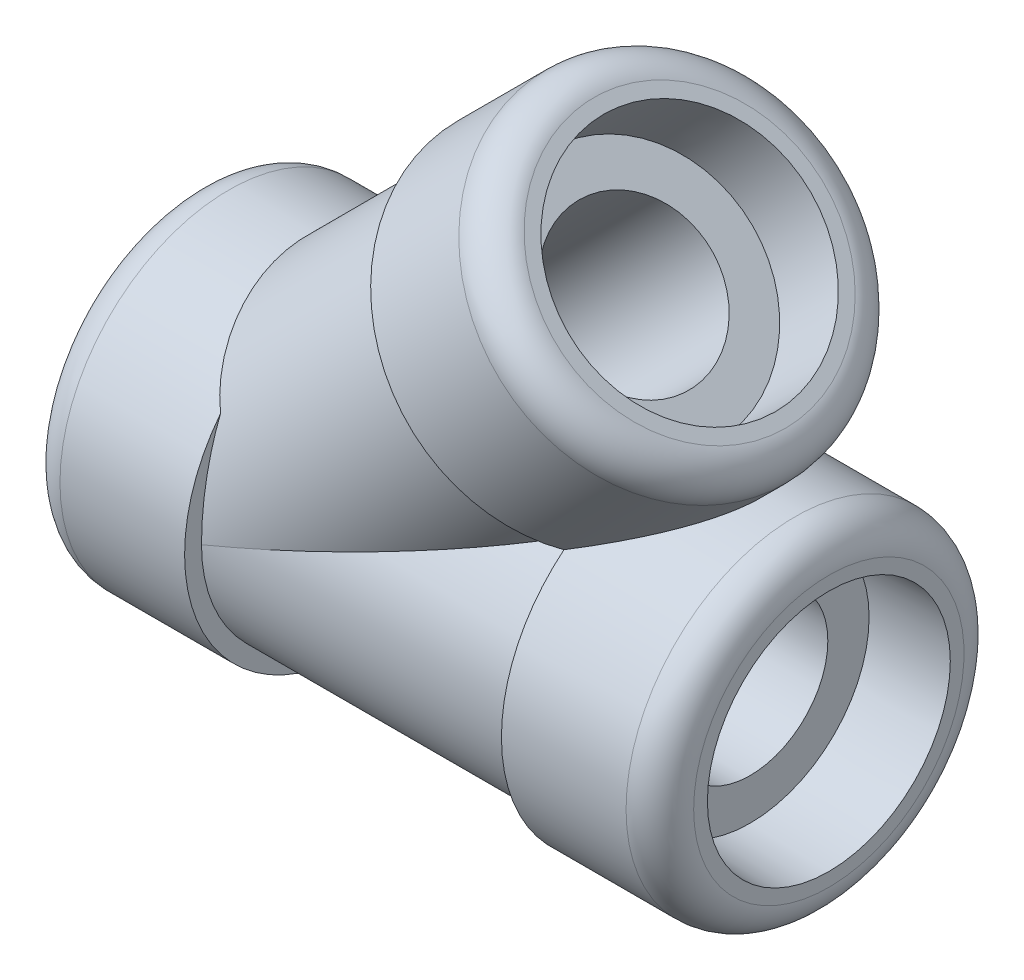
ISO-10303-21;
HEADER;
FILE_DESCRIPTION(('STEP AP214'),'2;1');
FILE_NAME('part.step','',(''),(''),'','','');
FILE_SCHEMA(('AUTOMOTIVE_DESIGN { 1 0 10303 214 1 1 1 1 }'));
ENDSEC;
DATA;
#1=APPLICATION_CONTEXT('core data for automotive mechanical design processes');
#2=APPLICATION_PROTOCOL_DEFINITION('international standard','automotive_design',2000,#1);
#3=PRODUCT_CONTEXT('',#1,'mechanical');
#4=PRODUCT('Part','Part','',(#3));
#5=PRODUCT_RELATED_PRODUCT_CATEGORY('part','',(#4));
#6=PRODUCT_DEFINITION_FORMATION('','',#4);
#7=PRODUCT_DEFINITION_CONTEXT('part definition',#1,'design');
#8=PRODUCT_DEFINITION('design','',#6,#7);
#9=PRODUCT_DEFINITION_SHAPE('','',#8);
#10=(LENGTH_UNIT() NAMED_UNIT(*) SI_UNIT(.MILLI.,.METRE.));
#11=(NAMED_UNIT(*) PLANE_ANGLE_UNIT() SI_UNIT($,.RADIAN.));
#12=(NAMED_UNIT(*) SI_UNIT($,.STERADIAN.) SOLID_ANGLE_UNIT());
#13=UNCERTAINTY_MEASURE_WITH_UNIT(LENGTH_MEASURE(1.E-05),#10,'distance_accuracy_value','');
#14=(GEOMETRIC_REPRESENTATION_CONTEXT(3) GLOBAL_UNCERTAINTY_ASSIGNED_CONTEXT((#13)) GLOBAL_UNIT_ASSIGNED_CONTEXT((#10,
#11,#12)) REPRESENTATION_CONTEXT('',''));
#15=CARTESIAN_POINT('',(0.,0.,0.));
#16=DIRECTION('',(0.,0.,1.));
#17=DIRECTION('',(1.,0.,0.));
#18=AXIS2_PLACEMENT_3D('',#15,#16,#17);
#19=CARTESIAN_POINT('',(-95.25,50.8,0.));
#20=DIRECTION('',(1.,0.,0.));
#21=DIRECTION('',(0.,0.,1.));
#22=AXIS2_PLACEMENT_3D('',#19,#20,#21);
#23=PLANE('',#22);
#24=CARTESIAN_POINT('',(-95.25,0.,0.));
#25=DIRECTION('',(1.,0.,0.));
#26=DIRECTION('',(0.,0.,-1.));
#27=AXIS2_PLACEMENT_3D('',#24,#25,#26);
#28=CIRCLE('',#27,40.64);
#29=CARTESIAN_POINT('',(-95.25,0.,-40.64));
#30=VERTEX_POINT('',#29);
#31=EDGE_CURVE('E44',#30,#30,#28,.F.);
#32=ORIENTED_EDGE('',*,*,#31,.T.);
#33=EDGE_LOOP('',(#32));
#34=FACE_BOUND('',#33,.T.);
#35=CARTESIAN_POINT('',(-95.25,0.,0.));
#36=DIRECTION('',(-1.,0.,0.));
#37=DIRECTION('',(0.,0.,1.));
#38=AXIS2_PLACEMENT_3D('',#35,#36,#37);
#39=CIRCLE('',#38,36.5125);
#40=CARTESIAN_POINT('',(-95.25,0.,36.5125));
#41=VERTEX_POINT('',#40);
#42=EDGE_CURVE('E95',#41,#41,#39,.T.);
#43=ORIENTED_EDGE('',*,*,#42,.F.);
#44=EDGE_LOOP('',(#43));
#45=FACE_BOUND('',#44,.T.);
#46=ADVANCED_FACE('F36',(#34,#45),#23,.F.);
#47=CARTESIAN_POINT('',(-119.601410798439,-71.9764107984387,0.));
#48=DIRECTION('',(-0.707106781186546,-0.707106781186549,0.));
#49=DIRECTION('',(0.,0.,1.));
#50=AXIS2_PLACEMENT_3D('',#47,#48,#49);
#51=CYLINDRICAL_SURFACE('',#50,45.72);
#52=CARTESIAN_POINT('',(-47.625,0.,0.));
#53=DIRECTION('',(-1.,0.,0.));
#54=DIRECTION('',(0.,-1.,0.));
#55=AXIS2_PLACEMENT_3D('',#52,#53,#54);
#56=ELLIPSE('',#55,64.657844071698,45.72);
#57=CARTESIAN_POINT('',(-47.625,0.,45.72));
#58=VERTEX_POINT('',#57);
#59=CARTESIAN_POINT('',(-47.625,31.3152231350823,39.9999599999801));
#60=VERTEX_POINT('',#59);
#61=EDGE_CURVE('E144',#58,#60,#56,.T.);
#62=ORIENTED_EDGE('',*,*,#61,.F.);
#63=CARTESIAN_POINT('',(-47.625,0.,0.));
#64=DIRECTION('',(-0.382683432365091,0.923879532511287,0.));
#65=DIRECTION('',(-0.923879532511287,-0.382683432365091,0.));
#66=AXIS2_PLACEMENT_3D('',#63,#64,#65);
#67=ELLIPSE('',#66,119.472117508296,45.72);
#68=CARTESIAN_POINT('',(47.625,39.4538418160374,23.1022242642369));
#69=VERTEX_POINT('',#68);
#70=EDGE_CURVE('E140',#58,#69,#67,.T.);
#71=ORIENTED_EDGE('',*,*,#70,.T.);
#72=CARTESIAN_POINT('',(19.7269209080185,67.3519209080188,0.));
#73=DIRECTION('',(0.707106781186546,0.707106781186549,0.));
#74=DIRECTION('',(0.,0.,1.));
#75=AXIS2_PLACEMENT_3D('',#72,#73,#74);
#76=CIRCLE('',#75,45.72);
#77=CARTESIAN_POINT('',(47.625,39.4538418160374,-23.1022242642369));
#78=VERTEX_POINT('',#77);
#79=EDGE_CURVE('E116',#78,#69,#76,.T.);
#80=ORIENTED_EDGE('',*,*,#79,.F.);
#81=CARTESIAN_POINT('',(-47.625,0.,-45.72));
#82=VERTEX_POINT('',#81);
#83=EDGE_CURVE('E138',#78,#82,#67,.T.);
#84=ORIENTED_EDGE('',*,*,#83,.T.);
#85=CARTESIAN_POINT('',(-47.625,31.3152231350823,-39.99995999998));
#86=VERTEX_POINT('',#85);
#87=EDGE_CURVE('E141',#86,#82,#56,.T.);
#88=ORIENTED_EDGE('',*,*,#87,.F.);
#89=CARTESIAN_POINT('',(45.0153848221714,42.063456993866,28.4834265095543));
#90=CARTESIAN_POINT('',(44.2594161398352,41.7796170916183,28.9025373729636));
#91=CARTESIAN_POINT('',(43.4978047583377,41.4943427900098,29.310382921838));
#92=CARTESIAN_POINT('',(41.9645590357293,40.9215694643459,30.1049131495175));
#93=CARTESIAN_POINT('',(41.1929258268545,40.6340706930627,30.4916001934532));
#94=CARTESIAN_POINT('',(39.6411426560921,40.057582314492,31.2450755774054));
#95=CARTESIAN_POINT('',(38.8609974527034,39.7685935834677,31.611874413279));
#96=CARTESIAN_POINT('',(37.2926775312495,39.1894944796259,32.3270052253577));
#97=CARTESIAN_POINT('',(36.5045025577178,38.8993840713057,32.6753366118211));
#98=CARTESIAN_POINT('',(34.9219468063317,38.318919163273,33.3541541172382));
#99=CARTESIAN_POINT('',(34.1275753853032,38.0285654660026,33.6846627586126));
#100=CARTESIAN_POINT('',(32.5322468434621,37.4476983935,34.3292593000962));
#101=CARTESIAN_POINT('',(31.7312895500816,37.1571850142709,34.6433467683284));
#102=CARTESIAN_POINT('',(29.3191692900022,36.2860041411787,35.5623276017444));
#103=CARTESIAN_POINT('',(27.6989119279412,35.7057524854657,36.1438737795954));
#104=CARTESIAN_POINT('',(24.4396570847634,34.5506953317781,37.249528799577));
#105=CARTESIAN_POINT('',(22.8006857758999,33.9758838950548,37.7737090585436));
#106=CARTESIAN_POINT('',(19.5041026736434,32.8347172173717,38.7697660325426));
#107=CARTESIAN_POINT('',(17.8464915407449,32.2683616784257,39.2416445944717));
#108=CARTESIAN_POINT('',(14.5135280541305,31.1483367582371,40.1364528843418));
#109=CARTESIAN_POINT('',(12.8381724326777,30.5946697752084,40.5593734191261));
#110=CARTESIAN_POINT('',(9.47054075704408,29.5054892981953,41.358456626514));
#111=CARTESIAN_POINT('',(7.77826550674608,28.9699749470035,41.7346215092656));
#112=CARTESIAN_POINT('',(5.28555368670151,28.203658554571,42.2525748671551));
#113=CARTESIAN_POINT('',(4.49181872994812,27.9629564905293,42.4121850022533));
#114=CARTESIAN_POINT('',(2.90053869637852,27.4879493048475,42.7215747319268));
#115=CARTESIAN_POINT('',(2.10299370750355,27.2536440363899,42.8713545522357));
#116=CARTESIAN_POINT('',(0.504050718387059,26.7924882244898,43.1610555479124));
#117=CARTESIAN_POINT('',(-0.297346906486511,26.5656369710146,43.3009776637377));
#118=CARTESIAN_POINT('',(-1.90422206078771,26.1206012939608,43.5708837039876));
#119=CARTESIAN_POINT('',(-2.70969960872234,25.9024169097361,43.7008675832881));
#120=CARTESIAN_POINT('',(-4.32630666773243,25.4758175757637,43.9509265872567));
#121=CARTESIAN_POINT('',(-5.13744356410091,25.2674202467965,44.0709841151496));
#122=CARTESIAN_POINT('',(-6.7641695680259,24.8625806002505,44.3006347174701));
#123=CARTESIAN_POINT('',(-7.57975861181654,24.6661381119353,44.4102279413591));
#124=CARTESIAN_POINT('',(-9.21551926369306,24.2873798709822,44.6184925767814));
#125=CARTESIAN_POINT('',(-10.035690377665,24.1050626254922,44.7171651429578));
#126=CARTESIAN_POINT('',(-11.680875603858,23.7571566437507,44.9029663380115));
#127=CARTESIAN_POINT('',(-12.5058895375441,23.5915672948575,44.9900953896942));
#128=CARTESIAN_POINT('',(-13.92025824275,23.3256008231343,45.1283928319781));
#129=CARTESIAN_POINT('',(-14.5083788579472,23.2202625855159,45.1826507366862));
#130=CARTESIAN_POINT('',(-15.6871208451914,23.0210089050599,45.284496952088));
#131=CARTESIAN_POINT('',(-16.2777421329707,22.9270930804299,45.3320854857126));
#132=CARTESIAN_POINT('',(-17.4616332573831,22.7522383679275,45.4200972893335));
#133=CARTESIAN_POINT('',(-18.0549038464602,22.6713034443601,45.4605183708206));
#134=CARTESIAN_POINT('',(-19.2437768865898,22.5242803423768,45.5335430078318));
#135=CARTESIAN_POINT('',(-19.8393793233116,22.4581920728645,45.5661466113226));
#136=CARTESIAN_POINT('',(-21.0311337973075,22.3431154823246,45.6226840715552));
#137=CARTESIAN_POINT('',(-21.6272805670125,22.2940840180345,45.6466398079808));
#138=CARTESIAN_POINT('',(-22.8212058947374,22.2152641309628,45.6850519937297));
#139=CARTESIAN_POINT('',(-23.4189845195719,22.1854765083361,45.6995080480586));
#140=CARTESIAN_POINT('',(-24.6150891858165,22.1478199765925,45.717770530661));
#141=CARTESIAN_POINT('',(-25.2134147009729,22.1399382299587,45.7215831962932));
#142=CARTESIAN_POINT('',(-26.4097774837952,22.1489494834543,45.7172183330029));
#143=CARTESIAN_POINT('',(-27.0078147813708,22.1658387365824,45.7090426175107));
#144=CARTESIAN_POINT('',(-28.3350739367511,22.2342770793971,45.6758021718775));
#145=CARTESIAN_POINT('',(-29.06388984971,22.292699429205,45.6473855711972));
#146=CARTESIAN_POINT('',(-30.514988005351,22.4565160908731,45.5670195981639));
#147=CARTESIAN_POINT('',(-31.2372708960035,22.5619056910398,45.5150725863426));
#148=CARTESIAN_POINT('',(-32.6684523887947,22.8238648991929,45.3842773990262));
#149=CARTESIAN_POINT('',(-33.3773780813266,22.9803155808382,45.3054917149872));
#150=CARTESIAN_POINT('',(-34.7771721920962,23.3469804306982,45.1176338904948));
#151=CARTESIAN_POINT('',(-35.468041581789,23.5571916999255,45.0085633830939));
#152=CARTESIAN_POINT('',(-36.8297095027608,24.0326335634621,44.7565107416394));
#153=CARTESIAN_POINT('',(-37.5003391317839,24.2982294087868,44.6133025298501));
#154=CARTESIAN_POINT('',(-38.8105210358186,24.879844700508,44.2915737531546));
#155=CARTESIAN_POINT('',(-39.4500730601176,25.1958645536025,44.1130529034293));
#156=CARTESIAN_POINT('',(-40.695061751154,25.8724272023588,43.7196834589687));
#157=CARTESIAN_POINT('',(-41.3004295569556,26.2330555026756,43.5047647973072));
#158=CARTESIAN_POINT('',(-42.4738547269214,26.9902001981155,43.039126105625));
#159=CARTESIAN_POINT('',(-43.0419055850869,27.386722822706,42.7883998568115));
#160=CARTESIAN_POINT('',(-43.9399791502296,28.0571611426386,42.3501197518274));
#161=CARTESIAN_POINT('',(-44.2812074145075,28.3230052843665,42.1729083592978));
#162=CARTESIAN_POINT('',(-44.9489603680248,28.8635669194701,41.8048027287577));
#163=CARTESIAN_POINT('',(-45.2754840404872,29.1382850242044,41.6139075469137));
#164=CARTESIAN_POINT('',(-46.2337676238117,29.9728256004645,41.0211453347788));
#165=CARTESIAN_POINT('',(-46.8442345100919,30.5430300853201,40.5992043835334));
#166=CARTESIAN_POINT('',(-48.0139714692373,31.6980730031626,39.7040028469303));
#167=CARTESIAN_POINT('',(-48.5731318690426,32.2829395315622,39.230636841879));
#168=CARTESIAN_POINT('',(-49.6440990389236,33.455158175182,38.2358882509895));
#169=CARTESIAN_POINT('',(-50.155904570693,34.042510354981,37.7145044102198));
#170=CARTESIAN_POINT('',(-50.9779868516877,35.0217836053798,36.8022681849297));
#171=CARTESIAN_POINT('',(-51.299921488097,35.4154944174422,36.4237130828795));
#172=CARTESIAN_POINT('',(-51.9253753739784,36.1977119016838,35.6464519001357));
#173=CARTESIAN_POINT('',(-52.2288934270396,36.5862182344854,35.247744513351));
#174=CARTESIAN_POINT('',(-52.818562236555,37.3560195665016,34.430842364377));
#175=CARTESIAN_POINT('',(-53.1047097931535,37.7373132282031,34.0126440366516));
#176=CARTESIAN_POINT('',(-53.660479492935,38.4908729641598,33.1574656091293));
#177=CARTESIAN_POINT('',(-53.9301000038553,38.8631381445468,32.7204836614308));
#178=CARTESIAN_POINT('',(-54.4534309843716,39.5968964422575,31.8285904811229));
#179=CARTESIAN_POINT('',(-54.7071460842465,39.9583926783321,31.373684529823));
#180=CARTESIAN_POINT('',(-55.1993650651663,40.6693200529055,30.446473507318));
#181=CARTESIAN_POINT('',(-55.4378675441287,41.0187500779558,29.9741668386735));
#182=CARTESIAN_POINT('',(-55.9000753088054,41.7041431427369,29.0129752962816));
#183=CARTESIAN_POINT('',(-56.1237833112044,42.040108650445,28.5240934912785));
#184=CARTESIAN_POINT('',(-56.5568284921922,42.6974512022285,27.5303974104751));
#185=CARTESIAN_POINT('',(-56.7661643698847,43.0188269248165,27.0255816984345));
#186=CARTESIAN_POINT('',(-57.3765314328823,43.9647474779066,25.4795584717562));
#187=CARTESIAN_POINT('',(-57.7560490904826,44.5652890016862,24.4148691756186));
#188=CARTESIAN_POINT('',(-58.4593711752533,45.6942182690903,22.2304022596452));
#189=CARTESIAN_POINT('',(-58.783174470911,46.2226045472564,21.110623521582));
#190=CARTESIAN_POINT('',(-59.3758249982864,47.2003461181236,18.8232253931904));
#191=CARTESIAN_POINT('',(-59.6446823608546,47.6497159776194,17.6556148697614));
#192=CARTESIAN_POINT('',(-60.1277409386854,48.4637073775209,15.2802296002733));
#193=CARTESIAN_POINT('',(-60.3419425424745,48.8283295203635,14.072455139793));
#194=CARTESIAN_POINT('',(-60.7166766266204,49.4698919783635,11.6183933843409));
#195=CARTESIAN_POINT('',(-60.8769070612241,49.7463383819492,10.3719306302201));
#196=CARTESIAN_POINT('',(-61.1418860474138,50.2051669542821,7.85597602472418));
#197=CARTESIAN_POINT('',(-61.2466340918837,50.3875482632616,6.58648396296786));
#198=CARTESIAN_POINT('',(-61.4004630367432,50.6558295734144,4.03405252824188));
#199=CARTESIAN_POINT('',(-61.449546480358,50.7417339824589,2.75111377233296));
#200=CARTESIAN_POINT('',(-61.4919514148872,50.8159328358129,0.181514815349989));
#201=CARTESIAN_POINT('',(-61.4852743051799,50.8042297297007,-1.10514529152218));
#202=CARTESIAN_POINT('',(-61.4172456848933,50.6852492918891,-3.63270359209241));
#203=CARTESIAN_POINT('',(-61.3575883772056,50.580933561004,-4.8737882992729));
#204=CARTESIAN_POINT('',(-61.1860364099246,50.2820918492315,-7.34137052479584));
#205=CARTESIAN_POINT('',(-61.0741429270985,50.0875679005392,-8.56786837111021));
#206=CARTESIAN_POINT('',(-60.798312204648,49.6107589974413,-10.9974993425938));
#207=CARTESIAN_POINT('',(-60.6343835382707,49.3284885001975,-12.2006362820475));
#208=CARTESIAN_POINT('',(-60.2546266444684,48.6796482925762,-14.5755681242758));
#209=CARTESIAN_POINT('',(-60.0387978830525,48.3130777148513,-15.7473627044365));
#210=CARTESIAN_POINT('',(-59.5541778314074,47.4983087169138,-18.0570491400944));
#211=CARTESIAN_POINT('',(-59.2851535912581,47.0497519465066,-19.19476558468));
#212=CARTESIAN_POINT('',(-58.6944830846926,46.0776515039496,-21.4235397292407));
#213=CARTESIAN_POINT('',(-58.3728362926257,45.5541070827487,-22.5145969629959));
#214=CARTESIAN_POINT('',(-57.6758799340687,44.4381492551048,-24.6442177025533));
#215=CARTESIAN_POINT('',(-57.3005257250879,43.8456786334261,-25.6827365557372));
#216=CARTESIAN_POINT('',(-56.494767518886,42.5997515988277,-27.7002906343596));
#217=CARTESIAN_POINT('',(-56.064364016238,41.9462957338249,-28.6793263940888));
#218=CARTESIAN_POINT('',(-55.3673716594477,40.9151370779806,-30.1157151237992));
#219=CARTESIAN_POINT('',(-55.1218012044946,40.5563122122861,-30.5970925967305));
#220=CARTESIAN_POINT('',(-54.6146549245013,39.8261803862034,-31.5415820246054));
#221=CARTESIAN_POINT('',(-54.353080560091,39.4548745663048,-32.004695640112));
#222=CARTESIAN_POINT('',(-53.8131886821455,38.7012047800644,-32.9120761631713));
#223=CARTESIAN_POINT('',(-53.5348656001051,38.3188371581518,-33.3563367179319));
#224=CARTESIAN_POINT('',(-52.9607835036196,37.5449367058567,-34.2250794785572));
#225=CARTESIAN_POINT('',(-52.6650263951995,37.1534048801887,-34.6495638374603));
#226=CARTESIAN_POINT('',(-52.0553505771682,36.3634308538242,-35.4777123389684));
#227=CARTESIAN_POINT('',(-51.7414476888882,35.9649948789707,-35.8813940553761));
#228=CARTESIAN_POINT('',(-51.0941272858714,35.1631225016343,-36.6675612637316));
#229=CARTESIAN_POINT('',(-50.7607106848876,34.7596863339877,-37.0500477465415));
#230=CARTESIAN_POINT('',(-50.0732364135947,33.9505922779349,-37.7928384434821));
#231=CARTESIAN_POINT('',(-49.7191916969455,33.544935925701,-38.1531562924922));
#232=CARTESIAN_POINT('',(-48.9887190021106,32.7340468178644,-38.8511062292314));
#233=CARTESIAN_POINT('',(-48.6122867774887,32.3288141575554,-39.1887339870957));
#234=CARTESIAN_POINT('',(-47.7497167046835,31.4332582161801,-39.9122842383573));
#235=CARTESIAN_POINT('',(-47.2576983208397,30.9438871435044,-40.2924270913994));
#236=CARTESIAN_POINT('',(-46.2350461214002,29.9785884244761,-41.0157027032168));
#237=CARTESIAN_POINT('',(-45.7044252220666,29.5026563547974,-41.3588477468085));
#238=CARTESIAN_POINT('',(-44.602759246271,28.5738556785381,-42.0058855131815));
#239=CARTESIAN_POINT('',(-44.0317987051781,28.1209420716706,-42.3098567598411));
#240=CARTESIAN_POINT('',(-42.8467767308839,27.2472152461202,-42.8777430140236));
#241=CARTESIAN_POINT('',(-42.2327153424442,26.8264019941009,-43.1416580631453));
#242=CARTESIAN_POINT('',(-40.9530639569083,26.0221150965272,-43.6315767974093));
#243=CARTESIAN_POINT('',(-40.2868874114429,25.63922617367,-43.8570169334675));
#244=CARTESIAN_POINT('',(-38.9137310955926,24.9277423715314,-44.2652940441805));
#245=CARTESIAN_POINT('',(-38.2067570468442,24.599139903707,-44.4481369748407));
#246=CARTESIAN_POINT('',(-36.7589091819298,24.0039794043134,-44.7723583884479));
#247=CARTESIAN_POINT('',(-36.0180702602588,23.7373591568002,-44.9137784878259));
#248=CARTESIAN_POINT('',(-34.5100925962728,23.2688405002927,-45.1582881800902));
#249=CARTESIAN_POINT('',(-33.7429496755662,23.0669524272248,-45.2613716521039));
#250=CARTESIAN_POINT('',(-32.1003757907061,22.7065986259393,-45.4433282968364));
#251=CARTESIAN_POINT('',(-31.2227741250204,22.5559738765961,-45.5179593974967));
#252=CARTESIAN_POINT('',(-29.4560002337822,22.3266366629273,-45.6308819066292));
#253=CARTESIAN_POINT('',(-28.5668249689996,22.2479434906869,-45.6691635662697));
#254=CARTESIAN_POINT('',(-27.2282667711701,22.1764416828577,-45.7038925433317));
#255=CARTESIAN_POINT('',(-26.7801912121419,22.1603820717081,-45.7116777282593));
#256=CARTESIAN_POINT('',(-25.8836715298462,22.1426685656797,-45.7202625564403));
#257=CARTESIAN_POINT('',(-25.4352274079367,22.1410146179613,-45.7210622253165));
#258=CARTESIAN_POINT('',(-24.5386064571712,22.1508673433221,-45.7162889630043));
#259=CARTESIAN_POINT('',(-24.0904295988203,22.1623720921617,-45.710716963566));
#260=CARTESIAN_POINT('',(-23.1946597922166,22.1973516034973,-45.6937408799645));
#261=CARTESIAN_POINT('',(-22.7470668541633,22.2208265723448,-45.6823366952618));
#262=CARTESIAN_POINT('',(-21.6601877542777,22.2910822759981,-45.6481082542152));
#263=CARTESIAN_POINT('',(-21.0213551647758,22.3435459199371,-45.6224809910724));
#264=CARTESIAN_POINT('',(-19.7460008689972,22.4677665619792,-45.5614335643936));
#265=CARTESIAN_POINT('',(-19.1094794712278,22.5395260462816,-45.5260121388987));
#266=CARTESIAN_POINT('',(-17.8388400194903,22.6998225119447,-45.446298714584));
#267=CARTESIAN_POINT('',(-17.2047231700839,22.7883669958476,-45.4020027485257));
#268=CARTESIAN_POINT('',(-15.9392926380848,22.9800171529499,-45.3053013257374));
#269=CARTESIAN_POINT('',(-15.3079791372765,23.083123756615,-45.2528953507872));
#270=CARTESIAN_POINT('',(-14.0470066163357,23.3022191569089,-45.1404670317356));
#271=CARTESIAN_POINT('',(-13.4173532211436,23.418232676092,-45.0804300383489));
#272=CARTESIAN_POINT('',(-12.1609021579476,23.6613687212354,-44.9532921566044));
#273=CARTESIAN_POINT('',(-11.5341045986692,23.788491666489,-44.8861910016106));
#274=CARTESIAN_POINT('',(-9.65825013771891,24.1843185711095,-44.6749145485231));
#275=CARTESIAN_POINT('',(-8.41336639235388,24.4675457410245,-44.5207332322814));
#276=CARTESIAN_POINT('',(-5.92561306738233,25.0659018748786,-44.186637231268));
#277=CARTESIAN_POINT('',(-4.68281710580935,25.3812381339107,-44.006551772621));
#278=CARTESIAN_POINT('',(-2.20714129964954,26.0355663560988,-43.622622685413));
#279=CARTESIAN_POINT('',(-0.974261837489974,26.3745592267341,-43.4187781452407));
#280=CARTESIAN_POINT('',(1.48089962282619,27.070814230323,-42.9881200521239));
#281=CARTESIAN_POINT('',(2.70319096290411,27.4280578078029,-42.7613296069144));
#282=CARTESIAN_POINT('',(5.13883927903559,28.1572770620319,-42.2847199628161));
#283=CARTESIAN_POINT('',(6.35219622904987,28.5292527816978,-42.0349006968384));
#284=CARTESIAN_POINT('',(9.21476231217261,29.4237916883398,-41.415882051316));
#285=CARTESIAN_POINT('',(10.8602042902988,29.9514388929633,-41.0365601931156));
#286=CARTESIAN_POINT('',(14.1349216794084,31.0225109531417,-40.2329755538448));
#287=CARTESIAN_POINT('',(15.7641967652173,31.5659361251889,-39.8087118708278));
#288=CARTESIAN_POINT('',(19.005922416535,32.6638754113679,-38.9128945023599));
#289=CARTESIAN_POINT('',(20.618373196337,33.2183893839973,-38.4413414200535));
#290=CARTESIAN_POINT('',(23.8252076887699,34.334660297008,-37.447692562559));
#291=CARTESIAN_POINT('',(25.4195907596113,34.8964174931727,-36.9255949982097));
#292=CARTESIAN_POINT('',(28.5527731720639,36.0111810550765,-35.8389071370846));
#293=CARTESIAN_POINT('',(30.0920195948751,36.5641036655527,-35.275522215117));
#294=CARTESIAN_POINT('',(33.1480065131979,37.6704919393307,-34.0915075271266));
#295=CARTESIAN_POINT('',(34.6647502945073,38.2239575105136,-33.470886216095));
#296=CARTESIAN_POINT('',(36.9206233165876,39.0524928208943,-32.491929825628));
#297=CARTESIAN_POINT('',(37.6697781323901,39.3285445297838,-32.1574109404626));
#298=CARTESIAN_POINT('',(39.1607040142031,39.8795673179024,-31.4714741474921));
#299=CARTESIAN_POINT('',(39.9024752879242,40.1545384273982,-31.1200567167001));
#300=CARTESIAN_POINT('',(41.3781970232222,40.7030744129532,-30.3990983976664));
#301=CARTESIAN_POINT('',(42.1121435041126,40.9766385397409,-30.0295487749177));
#302=CARTESIAN_POINT('',(43.5708956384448,41.5217215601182,-29.2712149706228));
#303=CARTESIAN_POINT('',(44.2957003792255,41.7932402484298,-28.882428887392));
#304=CARTESIAN_POINT('',(45.0153848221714,42.063456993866,-28.4834265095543));
#305=B_SPLINE_CURVE_WITH_KNOTS('',3,(#89,#90,#91,#92,#93,#94,#95,#96,#97,#98,#99,#100,#101,#102,
#103,#104,#105,#106,#107,#108,#109,#110,#111,#112,#113,#114,#115,#116,#117,#118,#119,#120,#121,
#122,#123,#124,#125,#126,#127,#128,#129,#130,#131,#132,#133,#134,#135,#136,#137,#138,#139,#140,
#141,#142,#143,#144,#145,#146,#147,#148,#149,#150,#151,#152,#153,#154,#155,#156,#157,#158,#159,
#160,#161,#162,#163,#164,#165,#166,#167,#168,#169,#170,#171,#172,#173,#174,#175,#176,#177,#178,
#179,#180,#181,#182,#183,#184,#185,#186,#187,#188,#189,#190,#191,#192,#193,#194,#195,#196,#197,
#198,#199,#200,#201,#202,#203,#204,#205,#206,#207,#208,#209,#210,#211,#212,#213,#214,#215,#216,
#217,#218,#219,#220,#221,#222,#223,#224,#225,#226,#227,#228,#229,#230,#231,#232,#233,#234,#235,
#236,#237,#238,#239,#240,#241,#242,#243,#244,#245,#246,#247,#248,#249,#250,#251,#252,#253,#254,
#255,#256,#257,#258,#259,#260,#261,#262,#263,#264,#265,#266,#267,#268,#269,#270,#271,#272,#273,
#274,#275,#276,#277,#278,#279,#280,#281,#282,#283,#284,#285,#286,#287,#288,#289,#290,#291,#292,
#293,#294,#295,#296,#297,#298,#299,#300,#301,#302,#303,#304),.UNSPECIFIED.,.F.,.F.,(4,2,2,2,2,2,
2,2,2,2,2,2,2,2,2,2,2,2,2,2,2,2,2,2,2,2,2,2,2,2,2,2,2,2,2,2,2,2,2,2,2,2,2,2,2,2,2,2,2,2,2,2,2,2,
2,2,2,2,2,2,2,2,2,2,2,2,2,2,2,2,2,2,2,2,2,2,2,2,2,2,2,2,2,2,2,2,2,2,2,2,2,2,2,2,2,2,2,2,2,2,2,2,
2,2,2,2,2,4),(0.,2.7291869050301,5.45806811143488,8.1854948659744,10.9130086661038,
13.6369908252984,16.3610445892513,21.8096818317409,27.2514568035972,32.6930395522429,
38.1356424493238,43.5779879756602,46.1118576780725,48.6456691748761,51.1792386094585,
53.7128195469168,56.250799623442,58.7887434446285,61.3264186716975,63.8640009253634,
65.6636871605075,67.4633132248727,69.2634878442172,71.0636514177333,72.8592279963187,
74.6548792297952,76.4494779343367,78.2438052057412,80.4372096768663,82.630394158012,
84.8185065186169,87.0065009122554,89.209408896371,91.4123346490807,93.6195503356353,
95.827149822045,97.2290237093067,98.6309943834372,101.434958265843,104.244782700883,
107.054680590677,108.956117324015,110.85767744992,112.759586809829,114.661683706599,
116.563224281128,118.464939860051,120.366305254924,122.267842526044,126.10286834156,
129.937972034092,133.772367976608,137.606736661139,141.462220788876,145.317740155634,
149.173083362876,153.02832981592,156.764561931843,160.500709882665,164.236242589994,
167.971813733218,171.72412093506,175.476465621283,179.231947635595,182.987395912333,
184.932957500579,186.878341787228,188.824376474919,190.770198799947,192.714349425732,
194.658409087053,196.601260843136,198.544482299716,200.916436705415,203.287601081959,
205.653935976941,208.02026841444,210.418737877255,212.816871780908,215.212588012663,
217.60868658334,220.28504724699,222.962125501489,224.307191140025,225.652251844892,
226.997115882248,228.34200310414,230.266037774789,232.190320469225,234.115465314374,
236.040733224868,237.969754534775,239.898848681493,243.75592086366,247.639697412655,
251.523623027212,255.403675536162,259.283739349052,264.590333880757,269.89703493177,
275.203668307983,280.510489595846,285.699117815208,290.886980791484,293.48375285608,
296.080451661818,298.678413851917,301.276633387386),.UNSPECIFIED.);
#306=EDGE_CURVE('E58',#60,#86,#305,.T.);
#307=ORIENTED_EDGE('',*,*,#306,.F.);
#308=EDGE_LOOP('',(#62,#71,#80,#84,#88,#307));
#309=FACE_BOUND('',#308,.T.);
#310=ADVANCED_FACE('F152',(#309),#51,.T.);
#311=CARTESIAN_POINT('',(89.3239058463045,65.1068568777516,0.));
#312=DIRECTION('',(-0.707106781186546,-0.707106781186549,0.));
#313=DIRECTION('',(0.,0.,1.));
#314=AXIS2_PLACEMENT_3D('',#311,#312,#313);
#315=PLANE('',#314);
#316=CARTESIAN_POINT('',(53.4028813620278,101.027881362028,0.));
#317=DIRECTION('',(-0.707106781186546,-0.707106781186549,0.));
#318=DIRECTION('',(0.707106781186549,-0.707106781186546,0.));
#319=AXIS2_PLACEMENT_3D('',#316,#317,#318);
#320=CIRCLE('',#319,40.64);
#321=CARTESIAN_POINT('',(82.1397009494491,72.2910617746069,0.));
#322=VERTEX_POINT('',#321);
#323=EDGE_CURVE('E231',#322,#322,#320,.F.);
#324=ORIENTED_EDGE('',*,*,#323,.T.);
#325=EDGE_LOOP('',(#324));
#326=FACE_BOUND('',#325,.T.);
#327=CARTESIAN_POINT('',(53.4028813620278,101.027881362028,0.));
#328=DIRECTION('',(0.707106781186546,0.707106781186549,0.));
#329=DIRECTION('',(0.,0.,1.));
#330=AXIS2_PLACEMENT_3D('',#327,#328,#329);
#331=CIRCLE('',#330,36.5125);
#332=CARTESIAN_POINT('',(53.4028813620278,101.027881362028,36.5125));
#333=VERTEX_POINT('',#332);
#334=EDGE_CURVE('E104',#333,#333,#331,.T.);
#335=ORIENTED_EDGE('',*,*,#334,.F.);
#336=EDGE_LOOP('',(#335));
#337=FACE_BOUND('',#336,.T.);
#338=ADVANCED_FACE('F196',(#326,#337),#315,.F.);
#339=CARTESIAN_POINT('',(95.25,50.8,0.));
#340=DIRECTION('',(-1.,0.,0.));
#341=DIRECTION('',(0.,0.,1.));
#342=AXIS2_PLACEMENT_3D('',#339,#340,#341);
#343=PLANE('',#342);
#344=CARTESIAN_POINT('',(95.25,0.,0.));
#345=DIRECTION('',(-1.,0.,0.));
#346=DIRECTION('',(0.,0.,1.));
#347=AXIS2_PLACEMENT_3D('',#344,#345,#346);
#348=CIRCLE('',#347,40.64);
#349=CARTESIAN_POINT('',(95.25,0.,40.64));
#350=VERTEX_POINT('',#349);
#351=EDGE_CURVE('E223',#350,#350,#348,.F.);
#352=ORIENTED_EDGE('',*,*,#351,.T.);
#353=EDGE_LOOP('',(#352));
#354=FACE_BOUND('',#353,.T.);
#355=CARTESIAN_POINT('',(95.25,0.,0.));
#356=DIRECTION('',(-1.,0.,0.));
#357=DIRECTION('',(0.,0.,1.));
#358=AXIS2_PLACEMENT_3D('',#355,#356,#357);
#359=CIRCLE('',#358,36.5125);
#360=CARTESIAN_POINT('',(95.25,0.,36.5125));
#361=VERTEX_POINT('',#360);
#362=EDGE_CURVE('E110',#361,#361,#359,.T.);
#363=ORIENTED_EDGE('',*,*,#362,.T.);
#364=EDGE_LOOP('',(#363));
#365=FACE_BOUND('',#364,.T.);
#366=ADVANCED_FACE('F193',(#354,#365),#343,.F.);
#367=CARTESIAN_POINT('',(-149.415016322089,0.,0.));
#368=DIRECTION('',(-1.,0.,0.));
#369=DIRECTION('',(0.,0.,1.));
#370=AXIS2_PLACEMENT_3D('',#367,#368,#369);
#371=CYLINDRICAL_SURFACE('',#370,50.8);
#372=CARTESIAN_POINT('',(85.09,0.,0.));
#373=DIRECTION('',(-1.,0.,0.));
#374=DIRECTION('',(0.,0.,1.));
#375=AXIS2_PLACEMENT_3D('',#372,#373,#374);
#376=CIRCLE('',#375,50.8);
#377=CARTESIAN_POINT('',(85.09,0.,50.8));
#378=VERTEX_POINT('',#377);
#379=EDGE_CURVE('E226',#378,#378,#376,.T.);
#380=ORIENTED_EDGE('',*,*,#379,.T.);
#381=EDGE_LOOP('',(#380));
#382=FACE_BOUND('',#381,.T.);
#383=CARTESIAN_POINT('',(-47.625,0.,0.));
#384=DIRECTION('',(-0.382683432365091,0.923879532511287,0.));
#385=DIRECTION('',(-0.923879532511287,-0.382683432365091,0.));
#386=AXIS2_PLACEMENT_3D('',#383,#384,#385);
#387=ELLIPSE('',#386,132.74679723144,50.8);
#388=CARTESIAN_POINT('',(47.625,39.4538418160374,32.0005369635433));
#389=VERTEX_POINT('',#388);
#390=CARTESIAN_POINT('',(47.625,39.4538418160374,-32.0005369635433));
#391=VERTEX_POINT('',#390);
#392=EDGE_CURVE('E126',#389,#391,#387,.T.);
#393=ORIENTED_EDGE('',*,*,#392,.F.);
#394=CARTESIAN_POINT('',(47.625,0.,0.));
#395=DIRECTION('',(-1.,0.,0.));
#396=DIRECTION('',(0.,0.,1.));
#397=AXIS2_PLACEMENT_3D('',#394,#395,#396);
#398=CIRCLE('',#397,50.8);
#399=EDGE_CURVE('E135',#391,#389,#398,.T.);
#400=ORIENTED_EDGE('',*,*,#399,.F.);
#401=EDGE_LOOP('',(#393,#400));
#402=FACE_BOUND('',#401,.T.);
#403=ADVANCED_FACE('F195',(#382,#402),#371,.T.);
#404=CARTESIAN_POINT('',(47.625,45.72,0.));
#405=DIRECTION('',(1.,0.,0.));
#406=DIRECTION('',(0.,0.,-1.));
#407=AXIS2_PLACEMENT_3D('',#404,#405,#406);
#408=PLANE('',#407);
#409=DIRECTION('',(0.,0.,1.));
#410=VECTOR('',#409,1.);
#411=CARTESIAN_POINT('',(47.625,39.4538418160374,0.));
#412=LINE('',#411,#410);
#413=EDGE_CURVE('E125',#391,#78,#412,.T.);
#414=ORIENTED_EDGE('',*,*,#413,.F.);
#415=ORIENTED_EDGE('',*,*,#399,.T.);
#416=EDGE_CURVE('E122',#69,#389,#412,.T.);
#417=ORIENTED_EDGE('',*,*,#416,.F.);
#418=CARTESIAN_POINT('',(47.625,0.,0.));
#419=DIRECTION('',(-1.,0.,0.));
#420=DIRECTION('',(0.,0.,1.));
#421=AXIS2_PLACEMENT_3D('',#418,#419,#420);
#422=CIRCLE('',#421,45.72);
#423=EDGE_CURVE('E132',#78,#69,#422,.T.);
#424=ORIENTED_EDGE('',*,*,#423,.F.);
#425=EDGE_LOOP('',(#414,#415,#417,#424));
#426=FACE_BOUND('',#425,.T.);
#427=ADVANCED_FACE('F203',(#426),#408,.F.);
#428=CARTESIAN_POINT('',(-149.415016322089,0.,0.));
#429=DIRECTION('',(-1.,0.,0.));
#430=DIRECTION('',(0.,0.,1.));
#431=AXIS2_PLACEMENT_3D('',#428,#429,#430);
#432=CYLINDRICAL_SURFACE('',#431,45.72);
#433=ORIENTED_EDGE('',*,*,#70,.F.);
#434=CARTESIAN_POINT('',(-47.625,0.,0.));
#435=DIRECTION('',(-1.,0.,0.));
#436=DIRECTION('',(0.,0.,1.));
#437=AXIS2_PLACEMENT_3D('',#434,#435,#436);
#438=CIRCLE('',#437,45.72);
#439=EDGE_CURVE('E129',#82,#58,#438,.T.);
#440=ORIENTED_EDGE('',*,*,#439,.F.);
#441=ORIENTED_EDGE('',*,*,#83,.F.);
#442=ORIENTED_EDGE('',*,*,#423,.T.);
#443=EDGE_LOOP('',(#433,#440,#441,#442));
#444=FACE_BOUND('',#443,.T.);
#445=ADVANCED_FACE('F297',(#444),#432,.T.);
#446=CARTESIAN_POINT('',(-119.601410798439,-71.9764107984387,0.));
#447=DIRECTION('',(-0.707106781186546,-0.707106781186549,0.));
#448=DIRECTION('',(0.,0.,1.));
#449=AXIS2_PLACEMENT_3D('',#446,#447,#448);
#450=CYLINDRICAL_SURFACE('',#449,50.8);
#451=CARTESIAN_POINT('',(46.2186764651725,93.8436764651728,0.));
#452=DIRECTION('',(-0.707106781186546,-0.707106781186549,0.));
#453=DIRECTION('',(0.707106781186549,-0.707106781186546,0.));
#454=AXIS2_PLACEMENT_3D('',#451,#452,#453);
#455=CIRCLE('',#454,50.8);
#456=CARTESIAN_POINT('',(82.1397009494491,57.9226519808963,0.));
#457=VERTEX_POINT('',#456);
#458=EDGE_CURVE('E227',#457,#457,#455,.T.);
#459=ORIENTED_EDGE('',*,*,#458,.T.);
#460=EDGE_LOOP('',(#459));
#461=FACE_BOUND('',#460,.T.);
#462=CARTESIAN_POINT('',(19.7269209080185,67.3519209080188,0.));
#463=DIRECTION('',(0.707106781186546,0.707106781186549,0.));
#464=DIRECTION('',(0.,0.,1.));
#465=AXIS2_PLACEMENT_3D('',#462,#463,#464);
#466=CIRCLE('',#465,50.8);
#467=EDGE_CURVE('E119',#391,#389,#466,.T.);
#468=ORIENTED_EDGE('',*,*,#467,.T.);
#469=ORIENTED_EDGE('',*,*,#392,.T.);
#470=EDGE_LOOP('',(#468,#469));
#471=FACE_BOUND('',#470,.T.);
#472=ADVANCED_FACE('F185',(#461,#471),#450,.T.);
#473=CARTESIAN_POINT('',(52.0558429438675,35.0229988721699,0.));
#474=DIRECTION('',(0.707106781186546,0.707106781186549,0.));
#475=DIRECTION('',(0.,0.,-1.));
#476=AXIS2_PLACEMENT_3D('',#473,#474,#475);
#477=PLANE('',#476);
#478=ORIENTED_EDGE('',*,*,#467,.F.);
#479=ORIENTED_EDGE('',*,*,#413,.T.);
#480=ORIENTED_EDGE('',*,*,#79,.T.);
#481=ORIENTED_EDGE('',*,*,#416,.T.);
#482=EDGE_LOOP('',(#478,#479,#480,#481));
#483=FACE_BOUND('',#482,.T.);
#484=ADVANCED_FACE('F180',(#483),#477,.F.);
#485=CARTESIAN_POINT('',(71.5772,0.,0.));
#486=DIRECTION('',(1.,0.,0.));
#487=DIRECTION('',(0.,0.,-1.));
#488=AXIS2_PLACEMENT_3D('',#485,#486,#487);
#489=PLANE('',#488);
#490=CARTESIAN_POINT('',(71.5772,0.,0.));
#491=DIRECTION('',(1.,0.,0.));
#492=DIRECTION('',(0.,0.,-1.));
#493=AXIS2_PLACEMENT_3D('',#490,#491,#492);
#494=CIRCLE('',#493,23.368);
#495=CARTESIAN_POINT('',(71.5772,0.,-23.368));
#496=VERTEX_POINT('',#495);
#497=EDGE_CURVE('E92',#496,#496,#494,.T.);
#498=ORIENTED_EDGE('',*,*,#497,.F.);
#499=EDGE_LOOP('',(#498));
#500=FACE_BOUND('',#499,.T.);
#501=CARTESIAN_POINT('',(71.5772,0.,0.));
#502=DIRECTION('',(-1.,0.,0.));
#503=DIRECTION('',(0.,0.,1.));
#504=AXIS2_PLACEMENT_3D('',#501,#502,#503);
#505=CIRCLE('',#504,35.7754451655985);
#506=CARTESIAN_POINT('',(71.5772,0.,35.7754451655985));
#507=VERTEX_POINT('',#506);
#508=EDGE_CURVE('E113',#507,#507,#505,.T.);
#509=ORIENTED_EDGE('',*,*,#508,.F.);
#510=EDGE_LOOP('',(#509));
#511=FACE_BOUND('',#510,.T.);
#512=ADVANCED_FACE('F177',(#500,#511),#489,.T.);
#513=CARTESIAN_POINT('',(95.25,0.,0.));
#514=DIRECTION('',(1.,0.,0.));
#515=DIRECTION('',(0.,0.,-1.));
#516=AXIS2_PLACEMENT_3D('',#513,#514,#515);
#517=CONICAL_SURFACE('',#516,36.5125,0.0311250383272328);
#518=ORIENTED_EDGE('',*,*,#508,.T.);
#519=EDGE_LOOP('',(#518));
#520=FACE_BOUND('',#519,.T.);
#521=ORIENTED_EDGE('',*,*,#362,.F.);
#522=EDGE_LOOP('',(#521));
#523=FACE_BOUND('',#522,.T.);
#524=ADVANCED_FACE('F174',(#520,#523),#517,.F.);
#525=CARTESIAN_POINT('',(36.6636839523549,84.2886839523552,0.));
#526=DIRECTION('',(0.707106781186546,0.707106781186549,0.));
#527=DIRECTION('',(0.,0.,-1.));
#528=AXIS2_PLACEMENT_3D('',#525,#526,#527);
#529=PLANE('',#528);
#530=CARTESIAN_POINT('',(36.663683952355,84.2886839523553,0.));
#531=DIRECTION('',(0.707106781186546,0.707106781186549,0.));
#532=DIRECTION('',(-0.707106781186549,0.707106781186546,0.));
#533=AXIS2_PLACEMENT_3D('',#530,#531,#532);
#534=CIRCLE('',#533,23.368);
#535=CARTESIAN_POINT('',(20.1400126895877,100.812355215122,0.));
#536=VERTEX_POINT('',#535);
#537=EDGE_CURVE('E86',#536,#536,#534,.F.);
#538=ORIENTED_EDGE('',*,*,#537,.T.);
#539=EDGE_LOOP('',(#538));
#540=FACE_BOUND('',#539,.T.);
#541=CARTESIAN_POINT('',(36.6636839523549,84.2886839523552,0.));
#542=DIRECTION('',(0.707106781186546,0.707106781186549,0.));
#543=DIRECTION('',(0.,0.,1.));
#544=AXIS2_PLACEMENT_3D('',#541,#542,#543);
#545=CIRCLE('',#544,35.7754451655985);
#546=CARTESIAN_POINT('',(36.6636839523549,84.2886839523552,35.7754451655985));
#547=VERTEX_POINT('',#546);
#548=EDGE_CURVE('E107',#547,#547,#545,.T.);
#549=ORIENTED_EDGE('',*,*,#548,.T.);
#550=EDGE_LOOP('',(#549));
#551=FACE_BOUND('',#550,.T.);
#552=ADVANCED_FACE('F170',(#540,#551),#529,.T.);
#553=CARTESIAN_POINT('',(53.4028813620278,101.027881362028,0.));
#554=DIRECTION('',(0.707106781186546,0.707106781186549,0.));
#555=DIRECTION('',(0.,0.,-1.));
#556=AXIS2_PLACEMENT_3D('',#553,#554,#555);
#557=CONICAL_SURFACE('',#556,36.5125,0.0311250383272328);
#558=ORIENTED_EDGE('',*,*,#548,.F.);
#559=EDGE_LOOP('',(#558));
#560=FACE_BOUND('',#559,.T.);
#561=ORIENTED_EDGE('',*,*,#334,.T.);
#562=EDGE_LOOP('',(#561));
#563=FACE_BOUND('',#562,.T.);
#564=ADVANCED_FACE('F162',(#560,#563),#557,.F.);
#565=CARTESIAN_POINT('',(149.415016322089,0.,0.));
#566=DIRECTION('',(1.,0.,0.));
#567=DIRECTION('',(0.,0.,1.));
#568=AXIS2_PLACEMENT_3D('',#565,#566,#567);
#569=CYLINDRICAL_SURFACE('',#568,50.8);
#570=CARTESIAN_POINT('',(-85.09,0.,0.));
#571=DIRECTION('',(1.,0.,0.));
#572=DIRECTION('',(0.,0.,-1.));
#573=AXIS2_PLACEMENT_3D('',#570,#571,#572);
#574=CIRCLE('',#573,50.8);
#575=CARTESIAN_POINT('',(-85.09,0.,-50.8));
#576=VERTEX_POINT('',#575);
#577=EDGE_CURVE('E11',#576,#576,#574,.T.);
#578=ORIENTED_EDGE('',*,*,#577,.T.);
#579=EDGE_LOOP('',(#578));
#580=FACE_BOUND('',#579,.T.);
#581=CARTESIAN_POINT('',(-47.625,0.,0.));
#582=DIRECTION('',(-1.,0.,0.));
#583=DIRECTION('',(0.,0.,1.));
#584=AXIS2_PLACEMENT_3D('',#581,#582,#583);
#585=CIRCLE('',#584,50.8);
#586=EDGE_CURVE('E101',#86,#60,#585,.T.);
#587=ORIENTED_EDGE('',*,*,#586,.T.);
#588=ORIENTED_EDGE('',*,*,#306,.T.);
#589=EDGE_LOOP('',(#587,#588));
#590=FACE_BOUND('',#589,.T.);
#591=ADVANCED_FACE('F156',(#580,#590),#569,.T.);
#592=CARTESIAN_POINT('',(-47.625,45.72,0.));
#593=DIRECTION('',(-1.,0.,0.));
#594=DIRECTION('',(0.,0.,-1.));
#595=AXIS2_PLACEMENT_3D('',#592,#593,#594);
#596=PLANE('',#595);
#597=ORIENTED_EDGE('',*,*,#439,.T.);
#598=ORIENTED_EDGE('',*,*,#61,.T.);
#599=ORIENTED_EDGE('',*,*,#586,.F.);
#600=ORIENTED_EDGE('',*,*,#87,.T.);
#601=EDGE_LOOP('',(#597,#598,#599,#600));
#602=FACE_BOUND('',#601,.T.);
#603=ADVANCED_FACE('F161',(#602),#596,.F.);
#604=CARTESIAN_POINT('',(-71.5772,0.,0.));
#605=DIRECTION('',(-1.,0.,0.));
#606=DIRECTION('',(0.,0.,-1.));
#607=AXIS2_PLACEMENT_3D('',#604,#605,#606);
#608=PLANE('',#607);
#609=CARTESIAN_POINT('',(-71.5772,0.,0.));
#610=DIRECTION('',(-1.,0.,0.));
#611=DIRECTION('',(0.,0.,1.));
#612=AXIS2_PLACEMENT_3D('',#609,#610,#611);
#613=CIRCLE('',#612,23.368);
#614=CARTESIAN_POINT('',(-71.5772,0.,23.368));
#615=VERTEX_POINT('',#614);
#616=EDGE_CURVE('E89',#615,#615,#613,.T.);
#617=ORIENTED_EDGE('',*,*,#616,.F.);
#618=EDGE_LOOP('',(#617));
#619=FACE_BOUND('',#618,.T.);
#620=CARTESIAN_POINT('',(-71.5772,0.,0.));
#621=DIRECTION('',(-1.,0.,0.));
#622=DIRECTION('',(0.,0.,1.));
#623=AXIS2_PLACEMENT_3D('',#620,#621,#622);
#624=CIRCLE('',#623,35.7754451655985);
#625=CARTESIAN_POINT('',(-71.5772,0.,35.7754451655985));
#626=VERTEX_POINT('',#625);
#627=EDGE_CURVE('E98',#626,#626,#624,.T.);
#628=ORIENTED_EDGE('',*,*,#627,.T.);
#629=EDGE_LOOP('',(#628));
#630=FACE_BOUND('',#629,.T.);
#631=ADVANCED_FACE('F241',(#619,#630),#608,.T.);
#632=CARTESIAN_POINT('',(-95.25,0.,0.));
#633=DIRECTION('',(-1.,0.,0.));
#634=DIRECTION('',(0.,0.,-1.));
#635=AXIS2_PLACEMENT_3D('',#632,#633,#634);
#636=CONICAL_SURFACE('',#635,36.5125,0.0311250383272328);
#637=ORIENTED_EDGE('',*,*,#627,.F.);
#638=EDGE_LOOP('',(#637));
#639=FACE_BOUND('',#638,.T.);
#640=ORIENTED_EDGE('',*,*,#42,.T.);
#641=EDGE_LOOP('',(#640));
#642=FACE_BOUND('',#641,.T.);
#643=ADVANCED_FACE('F239',(#639,#642),#636,.F.);
#644=CARTESIAN_POINT('',(-95.25,0.,0.));
#645=DIRECTION('',(1.,0.,0.));
#646=DIRECTION('',(0.,0.,-1.));
#647=AXIS2_PLACEMENT_3D('',#644,#645,#646);
#648=CYLINDRICAL_SURFACE('',#647,23.368);
#649=CARTESIAN_POINT('',(-47.625,0.,0.));
#650=DIRECTION('',(-0.38268343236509,0.923879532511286,0.));
#651=DIRECTION('',(0.923879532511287,0.382683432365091,0.));
#652=AXIS2_PLACEMENT_3D('',#649,#650,#651);
#653=ELLIPSE('',#652,61.0635267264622,23.368);
#654=CARTESIAN_POINT('',(-47.625,0.,-23.368));
#655=VERTEX_POINT('',#654);
#656=CARTESIAN_POINT('',(-47.625,0.,23.368));
#657=VERTEX_POINT('',#656);
#658=EDGE_CURVE('E80',#655,#657,#653,.F.);
#659=ORIENTED_EDGE('',*,*,#658,.F.);
#660=CARTESIAN_POINT('',(-47.625,0.,0.));
#661=DIRECTION('',(0.923879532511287,0.382683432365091,0.));
#662=DIRECTION('',(-0.38268343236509,0.923879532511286,0.));
#663=AXIS2_PLACEMENT_3D('',#660,#661,#662);
#664=ELLIPSE('',#663,25.2933409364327,23.368);
#665=EDGE_CURVE('E50',#657,#655,#664,.F.);
#666=ORIENTED_EDGE('',*,*,#665,.F.);
#667=EDGE_LOOP('',(#659,#666));
#668=FACE_BOUND('',#667,.T.);
#669=ORIENTED_EDGE('',*,*,#497,.T.);
#670=EDGE_LOOP('',(#669));
#671=FACE_BOUND('',#670,.T.);
#672=ORIENTED_EDGE('',*,*,#616,.T.);
#673=EDGE_LOOP('',(#672));
#674=FACE_BOUND('',#673,.T.);
#675=ADVANCED_FACE('F84',(#668,#671,#674),#648,.F.);
#676=CARTESIAN_POINT('',(-96.8385,-49.2135000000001,0.));
#677=DIRECTION('',(0.707106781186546,0.707106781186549,0.));
#678=DIRECTION('',(-0.707106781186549,0.707106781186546,0.));
#679=AXIS2_PLACEMENT_3D('',#676,#677,#678);
#680=CYLINDRICAL_SURFACE('',#679,23.368);
#681=ORIENTED_EDGE('',*,*,#537,.F.);
#682=EDGE_LOOP('',(#681));
#683=FACE_BOUND('',#682,.T.);
#684=ORIENTED_EDGE('',*,*,#665,.T.);
#685=ORIENTED_EDGE('',*,*,#658,.T.);
#686=EDGE_LOOP('',(#684,#685));
#687=FACE_BOUND('',#686,.T.);
#688=ADVANCED_FACE('F81',(#683,#687),#680,.F.);
#689=CARTESIAN_POINT('',(46.2186764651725,93.8436764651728,0.));
#690=DIRECTION('',(-0.707106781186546,-0.707106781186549,0.));
#691=DIRECTION('',(0.707106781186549,-0.707106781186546,0.));
#692=AXIS2_PLACEMENT_3D('',#689,#690,#691);
#693=TOROIDAL_SURFACE('',#692,40.64,10.16);
#694=ORIENTED_EDGE('',*,*,#458,.F.);
#695=EDGE_LOOP('',(#694));
#696=FACE_BOUND('',#695,.T.);
#697=ORIENTED_EDGE('',*,*,#323,.F.);
#698=EDGE_LOOP('',(#697));
#699=FACE_BOUND('',#698,.T.);
#700=ADVANCED_FACE('F211',(#696,#699),#693,.T.);
#701=CARTESIAN_POINT('',(85.09,0.,0.));
#702=DIRECTION('',(-1.,0.,0.));
#703=DIRECTION('',(0.,0.,1.));
#704=AXIS2_PLACEMENT_3D('',#701,#702,#703);
#705=TOROIDAL_SURFACE('',#704,40.64,10.16);
#706=ORIENTED_EDGE('',*,*,#351,.F.);
#707=EDGE_LOOP('',(#706));
#708=FACE_BOUND('',#707,.T.);
#709=ORIENTED_EDGE('',*,*,#379,.F.);
#710=EDGE_LOOP('',(#709));
#711=FACE_BOUND('',#710,.T.);
#712=ADVANCED_FACE('F213',(#708,#711),#705,.T.);
#713=CARTESIAN_POINT('',(-85.09,0.,0.));
#714=DIRECTION('',(1.,0.,0.));
#715=DIRECTION('',(0.,0.,-1.));
#716=AXIS2_PLACEMENT_3D('',#713,#714,#715);
#717=TOROIDAL_SURFACE('',#716,40.64,10.16);
#718=ORIENTED_EDGE('',*,*,#577,.F.);
#719=EDGE_LOOP('',(#718));
#720=FACE_BOUND('',#719,.T.);
#721=ORIENTED_EDGE('',*,*,#31,.F.);
#722=EDGE_LOOP('',(#721));
#723=FACE_BOUND('',#722,.T.);
#724=ADVANCED_FACE('F38',(#720,#723),#717,.T.);
#725=CLOSED_SHELL('',(#46,#310,#338,#366,#403,#427,#445,#472,#484,#512,#524,#552,#564,#591,#603,
#631,#643,#675,#688,#700,#712,#724));
#726=MANIFOLD_SOLID_BREP('B2',#725);
#727=ADVANCED_BREP_SHAPE_REPRESENTATION('',(#18,#726),#14);
#728=SHAPE_DEFINITION_REPRESENTATION(#9,#727);
ENDSEC;
END-ISO-10303-21;
